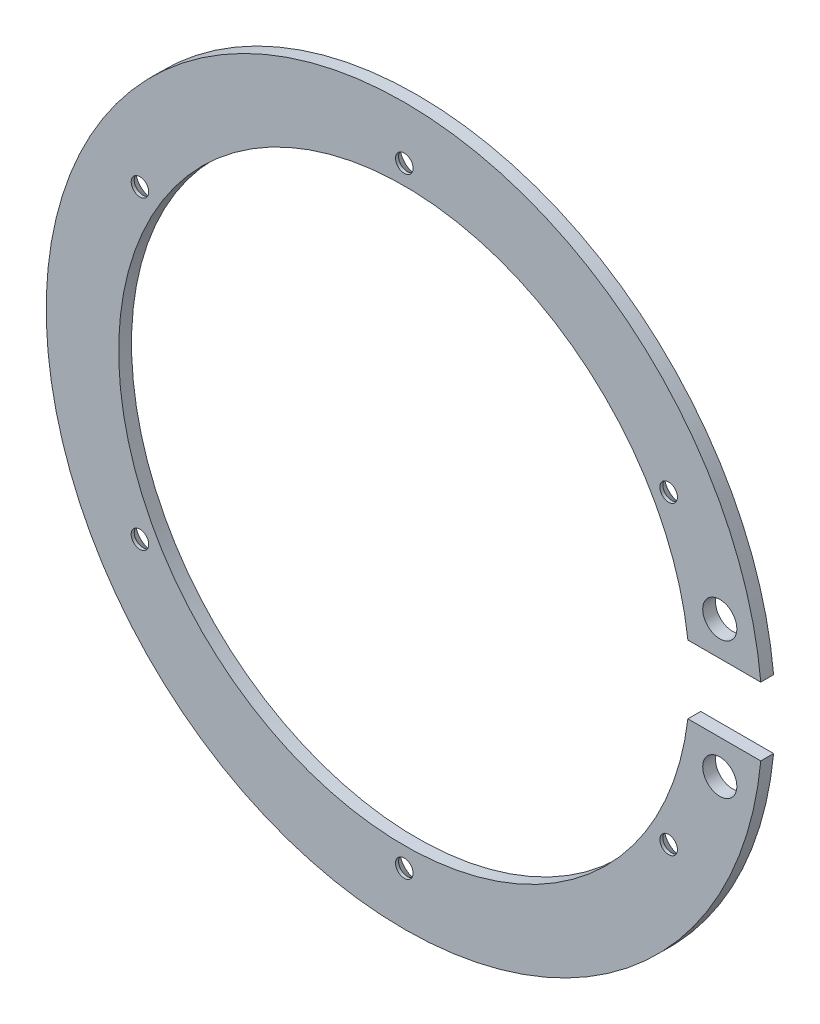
from build123d import *

# Parameters (mm, degrees)
SKETCH1_R           = 133.35
SKETCH1_R_2         = 106.3625
BOSS_EXTRUDE1_DEPTH = 4.7752
CIRPATTERN1_COUNT   = 6
SKETCH4_R           = 6.35
CUT_EXTRUDE1_DEPTH  = 189.64582565


with BuildPart() as part:
    # Sketch1 → Boss-Extrude1 (new body)
    with BuildSketch(Plane.XY):
        Circle(SKETCH1_R)
        Circle(SKETCH1_R_2, mode=Mode.SUBTRACT)
    extrude(amount=BOSS_EXTRUDE1_DEPTH)

    # Sketch2 → CSK for 1_4 Flat Head Machine Screw2 (revolve, cut)
    with BuildSketch(Plane(origin=(0, 113.665, 0), x_dir=(0, 1, 0), z_dir=(1, 0, 0))):
        Polygon((0, 0), (0, 4.7752), (3.2639, 4.7752), (3.2639, 3.652419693), (6.4389, 0), align=None)
    csk_for_1_4_flat_head_machine_screw2 = revolve(axis=Axis((0, 113.665, -6.35), (0, 0, 1)), mode=Mode.SUBTRACT)

    # CirPattern1: CSK for 1_4 Flat Head Machine Screw2 ×6 about axis
    cirpattern1_axis = Axis((0, 0, 0), (0, 0, 1))
    for i in range(1, CIRPATTERN1_COUNT):
        add(csk_for_1_4_flat_head_machine_screw2.rotate(cirpattern1_axis, i * 360 / CIRPATTERN1_COUNT), mode=Mode.SUBTRACT)

    # Sketch4 → Cut-Extrude1 (cut, through all)
    with BuildSketch(Plane(origin=(0, 0, 0), x_dir=(-1, 0, 0), z_dir=(0, 0, -1))):
        with Locations((-117.475, 25.4)):
            Circle(SKETCH4_R)
        with Locations((-117.475, -25.4)):
            Circle(SKETCH4_R)
        Polygon((-133.35, 0), (-133.35, 12.7), (-105.601569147, 12.7), (-105.601569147, -12.7), (-133.35, -12.7), align=None)
    extrude(amount=-CUT_EXTRUDE1_DEPTH, mode=Mode.SUBTRACT)


solid = part.part
